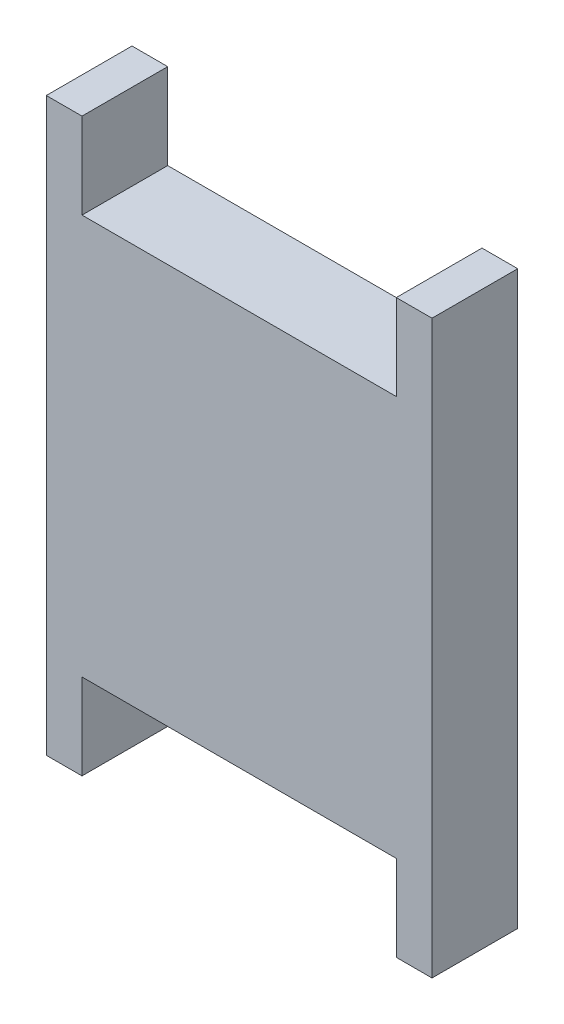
from build123d import *

# Parameters (mm, degrees)
SKETCH1_W           = 7.9375
SKETCH1_H           = 19.05
BOSS_EXTRUDE1_DEPTH = 19.05


with BuildPart() as part:
    # Sketch1 → Boss-Extrude1 (new body)
    with BuildSketch(Plane.XY):
        with Locations((3.96875, 98.425)):
            Rectangle(SKETCH1_W, SKETCH1_H)
        Polygon((7.9375, 88.9), (0, 88.9), (0, 44.45), (42.8625, 44.45), (42.8625, 88.9), align=None)
        Polygon((42.8625, 88.9), (42.8625, 44.45), (85.725, 44.45), (85.725, 88.9), (77.7875, 88.9), align=None)
        with Locations((81.75625, 98.425)):
            Rectangle(SKETCH1_W, SKETCH1_H)
        Polygon((42.8625, 44.45), (0, 44.45), (0, 0), (7.9375, 0), (42.8625, 0), align=None)
        Polygon((85.725, 44.45), (42.8625, 44.45), (42.8625, 0), (77.7875, 0), (85.725, 0), align=None)
        with Locations((81.75625, -9.525)):
            Rectangle(SKETCH1_W, SKETCH1_H)
        with Locations((3.96875, -9.525)):
            Rectangle(SKETCH1_W, SKETCH1_H)
    extrude(amount=BOSS_EXTRUDE1_DEPTH)


solid = part.part
